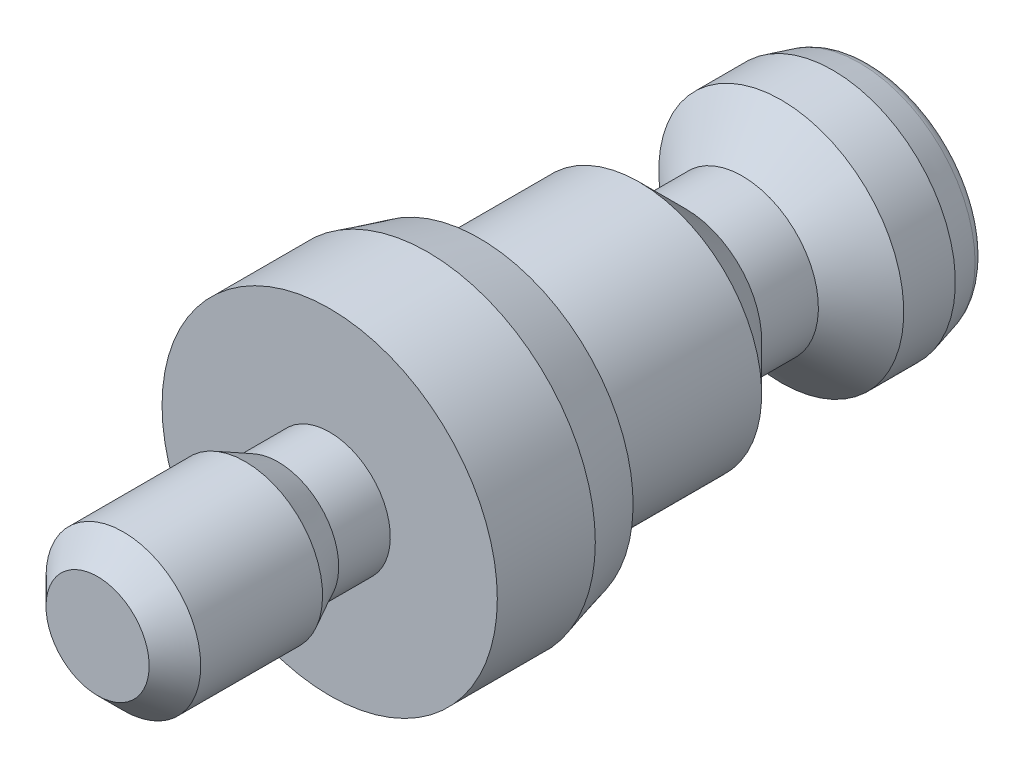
ISO-10303-21;
HEADER;
FILE_DESCRIPTION(('STEP AP214'),'2;1');
FILE_NAME('part.step','',(''),(''),'','','');
FILE_SCHEMA(('AUTOMOTIVE_DESIGN { 1 0 10303 214 1 1 1 1 }'));
ENDSEC;
DATA;
#1=APPLICATION_CONTEXT('core data for automotive mechanical design processes');
#2=APPLICATION_PROTOCOL_DEFINITION('international standard','automotive_design',2000,#1);
#3=PRODUCT_CONTEXT('',#1,'mechanical');
#4=PRODUCT('Part','Part','',(#3));
#5=PRODUCT_RELATED_PRODUCT_CATEGORY('part','',(#4));
#6=PRODUCT_DEFINITION_FORMATION('','',#4);
#7=PRODUCT_DEFINITION_CONTEXT('part definition',#1,'design');
#8=PRODUCT_DEFINITION('design','',#6,#7);
#9=PRODUCT_DEFINITION_SHAPE('','',#8);
#10=(LENGTH_UNIT() NAMED_UNIT(*) SI_UNIT(.MILLI.,.METRE.));
#11=(NAMED_UNIT(*) PLANE_ANGLE_UNIT() SI_UNIT($,.RADIAN.));
#12=(NAMED_UNIT(*) SI_UNIT($,.STERADIAN.) SOLID_ANGLE_UNIT());
#13=UNCERTAINTY_MEASURE_WITH_UNIT(LENGTH_MEASURE(1.E-05),#10,'distance_accuracy_value','');
#14=(GEOMETRIC_REPRESENTATION_CONTEXT(3) GLOBAL_UNCERTAINTY_ASSIGNED_CONTEXT((#13)) GLOBAL_UNIT_ASSIGNED_CONTEXT((#10,
#11,#12)) REPRESENTATION_CONTEXT('',''));
#15=CARTESIAN_POINT('',(0.,0.,0.));
#16=DIRECTION('',(0.,0.,1.));
#17=DIRECTION('',(1.,0.,0.));
#18=AXIS2_PLACEMENT_3D('',#15,#16,#17);
#19=CARTESIAN_POINT('',(0.,0.,0.));
#20=DIRECTION('',(0.,0.,-1.));
#21=DIRECTION('',(0.,1.,0.));
#22=AXIS2_PLACEMENT_3D('',#19,#20,#21);
#23=CYLINDRICAL_SURFACE('',#22,4.75);
#24=CARTESIAN_POINT('',(0.,0.,-12.));
#25=DIRECTION('',(0.,0.,-1.));
#26=DIRECTION('',(0.,1.,0.));
#27=AXIS2_PLACEMENT_3D('',#24,#25,#26);
#28=CIRCLE('',#27,4.75);
#29=CARTESIAN_POINT('',(0.,4.75000000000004,-12.));
#30=VERTEX_POINT('',#29);
#31=EDGE_CURVE('E140',#30,#30,#28,.T.);
#32=ORIENTED_EDGE('',*,*,#31,.F.);
#33=EDGE_LOOP('',(#32));
#34=FACE_BOUND('',#33,.T.);
#35=CARTESIAN_POINT('',(0.,0.,-5.8));
#36=DIRECTION('',(0.,0.,1.));
#37=DIRECTION('',(0.,-1.,0.));
#38=AXIS2_PLACEMENT_3D('',#35,#36,#37);
#39=CIRCLE('',#38,4.75);
#40=CARTESIAN_POINT('',(0.,-4.74999999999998,-5.80000000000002));
#41=VERTEX_POINT('',#40);
#42=EDGE_CURVE('E125',#41,#41,#39,.T.);
#43=ORIENTED_EDGE('',*,*,#42,.F.);
#44=EDGE_LOOP('',(#43));
#45=FACE_BOUND('',#44,.T.);
#46=ADVANCED_FACE('F16',(#34,#45),#23,.T.);
#47=CARTESIAN_POINT('',(0.,0.,-13.8));
#48=DIRECTION('',(0.,0.,1.));
#49=DIRECTION('',(0.,-1.,0.));
#50=AXIS2_PLACEMENT_3D('',#47,#48,#49);
#51=CONICAL_SURFACE('',#50,2.95,0.785398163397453);
#52=ORIENTED_EDGE('',*,*,#31,.T.);
#53=EDGE_LOOP('',(#52));
#54=FACE_BOUND('',#53,.T.);
#55=CARTESIAN_POINT('',(0.,0.,-13.8));
#56=DIRECTION('',(0.,0.,-1.));
#57=DIRECTION('',(0.,1.,0.));
#58=AXIS2_PLACEMENT_3D('',#55,#56,#57);
#59=CIRCLE('',#58,2.95);
#60=CARTESIAN_POINT('',(0.,2.95000000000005,-13.8));
#61=VERTEX_POINT('',#60);
#62=EDGE_CURVE('E137',#61,#61,#59,.T.);
#63=ORIENTED_EDGE('',*,*,#62,.F.);
#64=EDGE_LOOP('',(#63));
#65=FACE_BOUND('',#64,.T.);
#66=ADVANCED_FACE('F171',(#54,#65),#51,.T.);
#67=CARTESIAN_POINT('',(0.,0.,0.));
#68=DIRECTION('',(0.,0.,-1.));
#69=DIRECTION('',(0.,1.,0.));
#70=AXIS2_PLACEMENT_3D('',#67,#68,#69);
#71=CYLINDRICAL_SURFACE('',#70,2.95);
#72=ORIENTED_EDGE('',*,*,#62,.T.);
#73=EDGE_LOOP('',(#72));
#74=FACE_BOUND('',#73,.T.);
#75=CARTESIAN_POINT('',(0.,0.,-16.));
#76=DIRECTION('',(0.,0.,-1.));
#77=DIRECTION('',(0.,1.,0.));
#78=AXIS2_PLACEMENT_3D('',#75,#76,#77);
#79=CIRCLE('',#78,2.95);
#80=CARTESIAN_POINT('',(0.,2.95000000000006,-16.));
#81=VERTEX_POINT('',#80);
#82=EDGE_CURVE('E134',#81,#81,#79,.T.);
#83=ORIENTED_EDGE('',*,*,#82,.F.);
#84=EDGE_LOOP('',(#83));
#85=FACE_BOUND('',#84,.T.);
#86=ADVANCED_FACE('F178',(#74,#85),#71,.T.);
#87=CARTESIAN_POINT('',(0.,0.,-17.5103793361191));
#88=DIRECTION('',(0.,0.,-1.));
#89=DIRECTION('',(0.,1.,0.));
#90=AXIS2_PLACEMENT_3D('',#87,#88,#89);
#91=CONICAL_SURFACE('',#90,4.75,0.872664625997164);
#92=ORIENTED_EDGE('',*,*,#82,.T.);
#93=EDGE_LOOP('',(#92));
#94=FACE_BOUND('',#93,.T.);
#95=CARTESIAN_POINT('',(0.,0.,-17.5103793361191));
#96=DIRECTION('',(0.,0.,-1.));
#97=DIRECTION('',(0.,1.,0.));
#98=AXIS2_PLACEMENT_3D('',#95,#96,#97);
#99=CIRCLE('',#98,4.75);
#100=CARTESIAN_POINT('',(0.,4.75000000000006,-17.5103793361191));
#101=VERTEX_POINT('',#100);
#102=EDGE_CURVE('E131',#101,#101,#99,.T.);
#103=ORIENTED_EDGE('',*,*,#102,.F.);
#104=EDGE_LOOP('',(#103));
#105=FACE_BOUND('',#104,.T.);
#106=ADVANCED_FACE('F229',(#94,#105),#91,.T.);
#107=CARTESIAN_POINT('',(0.,0.,0.));
#108=DIRECTION('',(0.,0.,-1.));
#109=DIRECTION('',(0.,1.,0.));
#110=AXIS2_PLACEMENT_3D('',#107,#108,#109);
#111=CYLINDRICAL_SURFACE('',#110,4.75);
#112=ORIENTED_EDGE('',*,*,#102,.T.);
#113=EDGE_LOOP('',(#112));
#114=FACE_BOUND('',#113,.T.);
#115=CARTESIAN_POINT('',(0.,0.,-19.5103793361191));
#116=DIRECTION('',(0.,0.,-1.));
#117=DIRECTION('',(0.,1.,0.));
#118=AXIS2_PLACEMENT_3D('',#115,#116,#117);
#119=CIRCLE('',#118,4.75);
#120=CARTESIAN_POINT('',(0.,4.75000000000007,-19.5103793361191));
#121=VERTEX_POINT('',#120);
#122=EDGE_CURVE('E128',#121,#121,#119,.T.);
#123=ORIENTED_EDGE('',*,*,#122,.F.);
#124=EDGE_LOOP('',(#123));
#125=FACE_BOUND('',#124,.T.);
#126=ADVANCED_FACE('F220',(#114,#125),#111,.T.);
#127=CARTESIAN_POINT('',(0.,0.,-21.));
#128=DIRECTION('',(0.,0.,1.));
#129=DIRECTION('',(0.,-1.,0.));
#130=AXIS2_PLACEMENT_3D('',#127,#128,#129);
#131=CONICAL_SURFACE('',#130,4.3508573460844,0.26179938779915);
#132=CARTESIAN_POINT('',(0.,0.,-20.5552914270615));
#133=DIRECTION('',(0.,0.,-1.));
#134=DIRECTION('',(0.,1.,0.));
#135=AXIS2_PLACEMENT_3D('',#132,#133,#134);
#136=CIRCLE('',#135,4.47001664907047);
#137=CARTESIAN_POINT('',(0.,4.47001664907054,-20.5552914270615));
#138=VERTEX_POINT('',#137);
#139=EDGE_CURVE('E152',#138,#138,#136,.F.);
#140=ORIENTED_EDGE('',*,*,#139,.T.);
#141=EDGE_LOOP('',(#140));
#142=FACE_BOUND('',#141,.T.);
#143=ORIENTED_EDGE('',*,*,#122,.T.);
#144=EDGE_LOOP('',(#143));
#145=FACE_BOUND('',#144,.T.);
#146=ADVANCED_FACE('F211',(#142,#145),#131,.T.);
#147=CARTESIAN_POINT('',(4.3508573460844,0.,-21.));
#148=DIRECTION('',(0.,0.,-1.));
#149=DIRECTION('',(0.,1.,0.));
#150=AXIS2_PLACEMENT_3D('',#147,#148,#149);
#151=PLANE('',#150);
#152=DIRECTION('',(0.866025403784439,-0.5,0.));
#153=VECTOR('',#152,1.);
#154=CARTESIAN_POINT('',(0.,1.73205080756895,-21.));
#155=LINE('',#154,#153);
#156=CARTESIAN_POINT('',(0.,1.73205080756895,-21.));
#157=VERTEX_POINT('',#156);
#158=CARTESIAN_POINT('',(1.5,0.866025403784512,-21.));
#159=VERTEX_POINT('',#158);
#160=EDGE_CURVE('E417',#157,#159,#155,.T.);
#161=ORIENTED_EDGE('',*,*,#160,.F.);
#162=DIRECTION('',(0.866025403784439,0.5,0.));
#163=VECTOR('',#162,1.);
#164=CARTESIAN_POINT('',(-1.5,0.866025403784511,-21.));
#165=LINE('',#164,#163);
#166=CARTESIAN_POINT('',(-1.5,0.866025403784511,-21.));
#167=VERTEX_POINT('',#166);
#168=EDGE_CURVE('E100',#167,#157,#165,.T.);
#169=ORIENTED_EDGE('',*,*,#168,.F.);
#170=DIRECTION('',(0.,1.,0.));
#171=VECTOR('',#170,1.);
#172=CARTESIAN_POINT('',(-1.5,-0.866025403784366,-21.));
#173=LINE('',#172,#171);
#174=CARTESIAN_POINT('',(-1.5,-0.866025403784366,-21.));
#175=VERTEX_POINT('',#174);
#176=EDGE_CURVE('E422',#175,#167,#173,.T.);
#177=ORIENTED_EDGE('',*,*,#176,.F.);
#178=DIRECTION('',(-0.866025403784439,0.5,0.));
#179=VECTOR('',#178,1.);
#180=CARTESIAN_POINT('',(0.,-1.7320508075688,-21.));
#181=LINE('',#180,#179);
#182=CARTESIAN_POINT('',(0.,-1.7320508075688,-21.));
#183=VERTEX_POINT('',#182);
#184=EDGE_CURVE('E424',#183,#175,#181,.T.);
#185=ORIENTED_EDGE('',*,*,#184,.F.);
#186=DIRECTION('',(-0.866025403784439,-0.5,0.));
#187=VECTOR('',#186,1.);
#188=CARTESIAN_POINT('',(1.5,-0.866025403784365,-21.));
#189=LINE('',#188,#187);
#190=CARTESIAN_POINT('',(1.5,-0.866025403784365,-21.));
#191=VERTEX_POINT('',#190);
#192=EDGE_CURVE('E60',#191,#183,#189,.T.);
#193=ORIENTED_EDGE('',*,*,#192,.F.);
#194=DIRECTION('',(0.,-1.,0.));
#195=VECTOR('',#194,1.);
#196=CARTESIAN_POINT('',(1.5,0.866025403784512,-21.));
#197=LINE('',#196,#195);
#198=EDGE_CURVE('E56',#159,#191,#197,.T.);
#199=ORIENTED_EDGE('',*,*,#198,.F.);
#200=EDGE_LOOP('',(#161,#169,#177,#185,#193,#199));
#201=FACE_BOUND('',#200,.T.);
#202=CARTESIAN_POINT('',(0.,0.,-21.));
#203=DIRECTION('',(0.,0.,-1.));
#204=DIRECTION('',(0.,1.,0.));
#205=AXIS2_PLACEMENT_3D('',#202,#203,#204);
#206=CIRCLE('',#205,3.89046115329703);
#207=CARTESIAN_POINT('',(0.,3.8904611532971,-21.));
#208=VERTEX_POINT('',#207);
#209=EDGE_CURVE('E149',#208,#208,#206,.T.);
#210=ORIENTED_EDGE('',*,*,#209,.T.);
#211=EDGE_LOOP('',(#210));
#212=FACE_BOUND('',#211,.T.);
#213=ADVANCED_FACE('F208',(#201,#212),#151,.T.);
#214=CARTESIAN_POINT('',(4.75,0.,-5.8));
#215=DIRECTION('',(0.,0.,1.));
#216=DIRECTION('',(0.,-1.,0.));
#217=AXIS2_PLACEMENT_3D('',#214,#215,#216);
#218=PLANE('',#217);
#219=CARTESIAN_POINT('',(0.,0.,-5.8));
#220=DIRECTION('',(0.,0.,1.));
#221=DIRECTION('',(0.,-1.,0.));
#222=AXIS2_PLACEMENT_3D('',#219,#220,#221);
#223=CIRCLE('',#222,5.96410161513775);
#224=CARTESIAN_POINT('',(0.,-5.96410161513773,-5.80000000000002));
#225=VERTEX_POINT('',#224);
#226=EDGE_CURVE('E10',#225,#225,#223,.F.);
#227=ORIENTED_EDGE('',*,*,#226,.T.);
#228=EDGE_LOOP('',(#227));
#229=FACE_BOUND('',#228,.T.);
#230=ORIENTED_EDGE('',*,*,#42,.T.);
#231=EDGE_LOOP('',(#230));
#232=FACE_BOUND('',#231,.T.);
#233=ADVANCED_FACE('F210',(#229,#232),#218,.F.);
#234=CARTESIAN_POINT('',(0.,0.,0.));
#235=DIRECTION('',(0.,0.,1.));
#236=DIRECTION('',(0.,-1.,0.));
#237=AXIS2_PLACEMENT_3D('',#234,#235,#236);
#238=CYLINDRICAL_SURFACE('',#237,6.5);
#239=CARTESIAN_POINT('',(0.,0.,-3.8));
#240=DIRECTION('',(0.,0.,1.));
#241=DIRECTION('',(0.,-1.,0.));
#242=AXIS2_PLACEMENT_3D('',#239,#240,#241);
#243=CIRCLE('',#242,6.5);
#244=CARTESIAN_POINT('',(0.,-6.49999999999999,-3.80000000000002));
#245=VERTEX_POINT('',#244);
#246=EDGE_CURVE('E25',#245,#245,#243,.T.);
#247=ORIENTED_EDGE('',*,*,#246,.T.);
#248=EDGE_LOOP('',(#247));
#249=FACE_BOUND('',#248,.T.);
#250=CARTESIAN_POINT('',(0.,0.,0.));
#251=DIRECTION('',(0.,0.,1.));
#252=DIRECTION('',(0.,-1.,0.));
#253=AXIS2_PLACEMENT_3D('',#250,#251,#252);
#254=CIRCLE('',#253,6.5);
#255=CARTESIAN_POINT('',(0.,-6.5,0.));
#256=VERTEX_POINT('',#255);
#257=EDGE_CURVE('E122',#256,#256,#254,.T.);
#258=ORIENTED_EDGE('',*,*,#257,.F.);
#259=EDGE_LOOP('',(#258));
#260=FACE_BOUND('',#259,.T.);
#261=ADVANCED_FACE('F157',(#249,#260),#238,.T.);
#262=CARTESIAN_POINT('',(0.,0.,0.));
#263=DIRECTION('',(0.,0.,1.));
#264=DIRECTION('',(0.,-1.,0.));
#265=AXIS2_PLACEMENT_3D('',#262,#263,#264);
#266=PLANE('',#265);
#267=ORIENTED_EDGE('',*,*,#257,.T.);
#268=EDGE_LOOP('',(#267));
#269=FACE_BOUND('',#268,.T.);
#270=CARTESIAN_POINT('',(0.,0.,0.));
#271=DIRECTION('',(0.,0.,-1.));
#272=DIRECTION('',(0.,1.,0.));
#273=AXIS2_PLACEMENT_3D('',#270,#271,#272);
#274=CIRCLE('',#273,2.35);
#275=CARTESIAN_POINT('',(0.,2.35,0.));
#276=VERTEX_POINT('',#275);
#277=EDGE_CURVE('E113',#276,#276,#274,.T.);
#278=ORIENTED_EDGE('',*,*,#277,.T.);
#279=EDGE_LOOP('',(#278));
#280=FACE_BOUND('',#279,.T.);
#281=ADVANCED_FACE('F185',(#269,#280),#266,.T.);
#282=CARTESIAN_POINT('',(0.,0.,3.27569682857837));
#283=DIRECTION('',(0.,0.,1.));
#284=DIRECTION('',(0.,-1.,0.));
#285=AXIS2_PLACEMENT_3D('',#282,#283,#284);
#286=CONICAL_SURFACE('',#285,3.,0.471238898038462);
#287=CARTESIAN_POINT('',(0.,0.,2.));
#288=DIRECTION('',(0.,0.,-1.));
#289=DIRECTION('',(0.,1.,0.));
#290=AXIS2_PLACEMENT_3D('',#287,#288,#289);
#291=CIRCLE('',#290,2.35);
#292=CARTESIAN_POINT('',(0.,2.34999999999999,2.00000000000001));
#293=VERTEX_POINT('',#292);
#294=EDGE_CURVE('E116',#293,#293,#291,.T.);
#295=ORIENTED_EDGE('',*,*,#294,.F.);
#296=EDGE_LOOP('',(#295));
#297=FACE_BOUND('',#296,.T.);
#298=CARTESIAN_POINT('',(0.,0.,3.27569682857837));
#299=DIRECTION('',(0.,0.,-1.));
#300=DIRECTION('',(0.,1.,0.));
#301=AXIS2_PLACEMENT_3D('',#298,#299,#300);
#302=CIRCLE('',#301,3.);
#303=CARTESIAN_POINT('',(0.,2.99999999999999,3.27569682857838));
#304=VERTEX_POINT('',#303);
#305=EDGE_CURVE('E119',#304,#304,#302,.T.);
#306=ORIENTED_EDGE('',*,*,#305,.T.);
#307=EDGE_LOOP('',(#306));
#308=FACE_BOUND('',#307,.T.);
#309=ADVANCED_FACE('F188',(#297,#308),#286,.T.);
#310=CARTESIAN_POINT('',(0.,0.,0.));
#311=DIRECTION('',(0.,0.,-1.));
#312=DIRECTION('',(0.,1.,0.));
#313=AXIS2_PLACEMENT_3D('',#310,#311,#312);
#314=CYLINDRICAL_SURFACE('',#313,2.35);
#315=ORIENTED_EDGE('',*,*,#277,.F.);
#316=EDGE_LOOP('',(#315));
#317=FACE_BOUND('',#316,.T.);
#318=ORIENTED_EDGE('',*,*,#294,.T.);
#319=EDGE_LOOP('',(#318));
#320=FACE_BOUND('',#319,.T.);
#321=ADVANCED_FACE('F382',(#317,#320),#314,.T.);
#322=CARTESIAN_POINT('',(0.,0.,9.));
#323=DIRECTION('',(0.,0.,1.));
#324=DIRECTION('',(0.,-1.,0.));
#325=AXIS2_PLACEMENT_3D('',#322,#323,#324);
#326=PLANE('',#325);
#327=CARTESIAN_POINT('',(0.,0.,9.));
#328=DIRECTION('',(0.,0.,1.));
#329=DIRECTION('',(0.,-1.,0.));
#330=AXIS2_PLACEMENT_3D('',#327,#328,#329);
#331=CIRCLE('',#330,2.);
#332=CARTESIAN_POINT('',(0.,-2.00000000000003,8.99999999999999));
#333=VERTEX_POINT('',#332);
#334=EDGE_CURVE('E146',#333,#333,#331,.T.);
#335=ORIENTED_EDGE('',*,*,#334,.T.);
#336=EDGE_LOOP('',(#335));
#337=FACE_BOUND('',#336,.T.);
#338=ADVANCED_FACE('F224',(#337),#326,.T.);
#339=CARTESIAN_POINT('',(0.,0.,0.));
#340=DIRECTION('',(0.,0.,-1.));
#341=DIRECTION('',(0.,1.,0.));
#342=AXIS2_PLACEMENT_3D('',#339,#340,#341);
#343=CYLINDRICAL_SURFACE('',#342,3.);
#344=CARTESIAN_POINT('',(0.,0.,8.));
#345=DIRECTION('',(0.,0.,1.));
#346=DIRECTION('',(0.,-1.,0.));
#347=AXIS2_PLACEMENT_3D('',#344,#345,#346);
#348=CIRCLE('',#347,3.);
#349=CARTESIAN_POINT('',(0.,-3.00000000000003,7.99999999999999));
#350=VERTEX_POINT('',#349);
#351=EDGE_CURVE('E143',#350,#350,#348,.F.);
#352=ORIENTED_EDGE('',*,*,#351,.T.);
#353=EDGE_LOOP('',(#352));
#354=FACE_BOUND('',#353,.T.);
#355=ORIENTED_EDGE('',*,*,#305,.F.);
#356=EDGE_LOOP('',(#355));
#357=FACE_BOUND('',#356,.T.);
#358=ADVANCED_FACE('F193',(#354,#357),#343,.T.);
#359=CARTESIAN_POINT('',(0.,0.,8.));
#360=DIRECTION('',(0.,0.,-1.));
#361=DIRECTION('',(0.,1.,0.));
#362=AXIS2_PLACEMENT_3D('',#359,#360,#361);
#363=CONICAL_SURFACE('',#362,3.,0.78539816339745);
#364=ORIENTED_EDGE('',*,*,#334,.F.);
#365=EDGE_LOOP('',(#364));
#366=FACE_BOUND('',#365,.T.);
#367=ORIENTED_EDGE('',*,*,#351,.F.);
#368=EDGE_LOOP('',(#367));
#369=FACE_BOUND('',#368,.T.);
#370=ADVANCED_FACE('F190',(#366,#369),#363,.T.);
#371=CARTESIAN_POINT('',(0.,0.,-20.4));
#372=DIRECTION('',(0.,0.,-1.));
#373=DIRECTION('',(0.,1.,0.));
#374=AXIS2_PLACEMENT_3D('',#371,#372,#373);
#375=TOROIDAL_SURFACE('',#374,3.89046115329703,0.6);
#376=ORIENTED_EDGE('',*,*,#139,.F.);
#377=EDGE_LOOP('',(#376));
#378=FACE_BOUND('',#377,.T.);
#379=ORIENTED_EDGE('',*,*,#209,.F.);
#380=EDGE_LOOP('',(#379));
#381=FACE_BOUND('',#380,.T.);
#382=ADVANCED_FACE('F192',(#378,#381),#375,.T.);
#383=CARTESIAN_POINT('',(1.5,-0.866025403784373,-18.5));
#384=DIRECTION('',(0.5,-0.866025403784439,0.));
#385=DIRECTION('',(0.866025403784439,0.5,0.));
#386=AXIS2_PLACEMENT_3D('',#383,#384,#385);
#387=PLANE('',#386);
#388=ORIENTED_EDGE('',*,*,#192,.T.);
#389=DIRECTION('',(0.,0.,-1.));
#390=VECTOR('',#389,1.);
#391=CARTESIAN_POINT('',(0.,-1.73205080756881,-18.5));
#392=LINE('',#391,#390);
#393=CARTESIAN_POINT('',(0.,-1.73205080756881,-18.5));
#394=VERTEX_POINT('',#393);
#395=EDGE_CURVE('E111',#394,#183,#392,.T.);
#396=ORIENTED_EDGE('',*,*,#395,.F.);
#397=DIRECTION('',(-0.866025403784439,-0.5,0.));
#398=VECTOR('',#397,1.);
#399=CARTESIAN_POINT('',(1.5,-0.866025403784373,-18.5));
#400=LINE('',#399,#398);
#401=CARTESIAN_POINT('',(1.5,-0.866025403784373,-18.5));
#402=VERTEX_POINT('',#401);
#403=EDGE_CURVE('E33',#402,#394,#400,.T.);
#404=ORIENTED_EDGE('',*,*,#403,.F.);
#405=DIRECTION('',(0.,0.,-1.));
#406=VECTOR('',#405,1.);
#407=CARTESIAN_POINT('',(1.5,-0.866025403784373,-18.5));
#408=LINE('',#407,#406);
#409=EDGE_CURVE('E103',#402,#191,#408,.T.);
#410=ORIENTED_EDGE('',*,*,#409,.T.);
#411=EDGE_LOOP('',(#388,#396,#404,#410));
#412=FACE_BOUND('',#411,.T.);
#413=ADVANCED_FACE('F196',(#412),#387,.F.);
#414=CARTESIAN_POINT('',(1.5,0.866025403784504,-18.5));
#415=DIRECTION('',(1.,0.,0.));
#416=DIRECTION('',(0.,1.,0.));
#417=AXIS2_PLACEMENT_3D('',#414,#415,#416);
#418=PLANE('',#417);
#419=ORIENTED_EDGE('',*,*,#198,.T.);
#420=ORIENTED_EDGE('',*,*,#409,.F.);
#421=DIRECTION('',(0.,-1.,0.));
#422=VECTOR('',#421,1.);
#423=CARTESIAN_POINT('',(1.5,0.866025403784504,-18.5));
#424=LINE('',#423,#422);
#425=CARTESIAN_POINT('',(1.5,0.866025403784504,-18.5));
#426=VERTEX_POINT('',#425);
#427=EDGE_CURVE('E87',#426,#402,#424,.T.);
#428=ORIENTED_EDGE('',*,*,#427,.F.);
#429=DIRECTION('',(0.,0.,-1.));
#430=VECTOR('',#429,1.);
#431=CARTESIAN_POINT('',(1.5,0.866025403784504,-18.5));
#432=LINE('',#431,#430);
#433=EDGE_CURVE('E85',#426,#159,#432,.T.);
#434=ORIENTED_EDGE('',*,*,#433,.T.);
#435=EDGE_LOOP('',(#419,#420,#428,#434));
#436=FACE_BOUND('',#435,.T.);
#437=ADVANCED_FACE('F202',(#436),#418,.F.);
#438=CARTESIAN_POINT('',(0.,1.73205080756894,-18.5));
#439=DIRECTION('',(0.5,0.866025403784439,0.));
#440=DIRECTION('',(-0.866025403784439,0.5,0.));
#441=AXIS2_PLACEMENT_3D('',#438,#439,#440);
#442=PLANE('',#441);
#443=ORIENTED_EDGE('',*,*,#160,.T.);
#444=ORIENTED_EDGE('',*,*,#433,.F.);
#445=DIRECTION('',(0.866025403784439,-0.5,0.));
#446=VECTOR('',#445,1.);
#447=CARTESIAN_POINT('',(0.,1.73205080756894,-18.5));
#448=LINE('',#447,#446);
#449=CARTESIAN_POINT('',(0.,1.73205080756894,-18.5));
#450=VERTEX_POINT('',#449);
#451=EDGE_CURVE('E79',#450,#426,#448,.T.);
#452=ORIENTED_EDGE('',*,*,#451,.F.);
#453=DIRECTION('',(0.,0.,-1.));
#454=VECTOR('',#453,1.);
#455=CARTESIAN_POINT('',(0.,1.73205080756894,-18.5));
#456=LINE('',#455,#454);
#457=EDGE_CURVE('E83',#450,#157,#456,.T.);
#458=ORIENTED_EDGE('',*,*,#457,.T.);
#459=EDGE_LOOP('',(#443,#444,#452,#458));
#460=FACE_BOUND('',#459,.T.);
#461=ADVANCED_FACE('F81',(#460),#442,.F.);
#462=CARTESIAN_POINT('',(-1.5,0.866025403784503,-18.5));
#463=DIRECTION('',(-0.5,0.866025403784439,0.));
#464=DIRECTION('',(-0.866025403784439,-0.5,0.));
#465=AXIS2_PLACEMENT_3D('',#462,#463,#464);
#466=PLANE('',#465);
#467=ORIENTED_EDGE('',*,*,#168,.T.);
#468=ORIENTED_EDGE('',*,*,#457,.F.);
#469=DIRECTION('',(0.866025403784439,0.5,0.));
#470=VECTOR('',#469,1.);
#471=CARTESIAN_POINT('',(-1.5,0.866025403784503,-18.5));
#472=LINE('',#471,#470);
#473=CARTESIAN_POINT('',(-1.5,0.866025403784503,-18.5));
#474=VERTEX_POINT('',#473);
#475=EDGE_CURVE('E88',#474,#450,#472,.T.);
#476=ORIENTED_EDGE('',*,*,#475,.F.);
#477=DIRECTION('',(0.,0.,-1.));
#478=VECTOR('',#477,1.);
#479=CARTESIAN_POINT('',(-1.5,0.866025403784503,-18.5));
#480=LINE('',#479,#478);
#481=EDGE_CURVE('E101',#474,#167,#480,.T.);
#482=ORIENTED_EDGE('',*,*,#481,.T.);
#483=EDGE_LOOP('',(#467,#468,#476,#482));
#484=FACE_BOUND('',#483,.T.);
#485=ADVANCED_FACE('F98',(#484),#466,.F.);
#486=CARTESIAN_POINT('',(-1.5,-0.866025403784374,-18.5));
#487=DIRECTION('',(-1.,0.,0.));
#488=DIRECTION('',(0.,-1.,0.));
#489=AXIS2_PLACEMENT_3D('',#486,#487,#488);
#490=PLANE('',#489);
#491=ORIENTED_EDGE('',*,*,#176,.T.);
#492=ORIENTED_EDGE('',*,*,#481,.F.);
#493=DIRECTION('',(0.,1.,0.));
#494=VECTOR('',#493,1.);
#495=CARTESIAN_POINT('',(-1.5,-0.866025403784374,-18.5));
#496=LINE('',#495,#494);
#497=CARTESIAN_POINT('',(-1.5,-0.866025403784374,-18.5));
#498=VERTEX_POINT('',#497);
#499=EDGE_CURVE('E92',#498,#474,#496,.T.);
#500=ORIENTED_EDGE('',*,*,#499,.F.);
#501=DIRECTION('',(0.,0.,-1.));
#502=VECTOR('',#501,1.);
#503=CARTESIAN_POINT('',(-1.5,-0.866025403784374,-18.5));
#504=LINE('',#503,#502);
#505=EDGE_CURVE('E105',#498,#175,#504,.T.);
#506=ORIENTED_EDGE('',*,*,#505,.T.);
#507=EDGE_LOOP('',(#491,#492,#500,#506));
#508=FACE_BOUND('',#507,.T.);
#509=ADVANCED_FACE('F334',(#508),#490,.F.);
#510=CARTESIAN_POINT('',(0.,-1.73205080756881,-18.5));
#511=DIRECTION('',(-0.5,-0.866025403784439,0.));
#512=DIRECTION('',(0.866025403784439,-0.5,0.));
#513=AXIS2_PLACEMENT_3D('',#510,#511,#512);
#514=PLANE('',#513);
#515=ORIENTED_EDGE('',*,*,#184,.T.);
#516=ORIENTED_EDGE('',*,*,#505,.F.);
#517=DIRECTION('',(-0.866025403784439,0.5,0.));
#518=VECTOR('',#517,1.);
#519=CARTESIAN_POINT('',(0.,-1.73205080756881,-18.5));
#520=LINE('',#519,#518);
#521=EDGE_CURVE('E68',#394,#498,#520,.T.);
#522=ORIENTED_EDGE('',*,*,#521,.F.);
#523=ORIENTED_EDGE('',*,*,#395,.T.);
#524=EDGE_LOOP('',(#515,#516,#522,#523));
#525=FACE_BOUND('',#524,.T.);
#526=ADVANCED_FACE('F167',(#525),#514,.F.);
#527=CARTESIAN_POINT('',(0.,0.,-18.5));
#528=DIRECTION('',(0.,0.,-1.));
#529=DIRECTION('',(0.,1.,0.));
#530=AXIS2_PLACEMENT_3D('',#527,#528,#529);
#531=PLANE('',#530);
#532=ORIENTED_EDGE('',*,*,#499,.T.);
#533=ORIENTED_EDGE('',*,*,#475,.T.);
#534=ORIENTED_EDGE('',*,*,#451,.T.);
#535=ORIENTED_EDGE('',*,*,#427,.T.);
#536=ORIENTED_EDGE('',*,*,#403,.T.);
#537=ORIENTED_EDGE('',*,*,#521,.T.);
#538=EDGE_LOOP('',(#532,#533,#534,#535,#536,#537));
#539=FACE_BOUND('',#538,.T.);
#540=ADVANCED_FACE('F91',(#539),#531,.T.);
#541=CARTESIAN_POINT('',(0.,0.,-3.8));
#542=DIRECTION('',(0.,0.,1.));
#543=DIRECTION('',(0.,-1.,0.));
#544=AXIS2_PLACEMENT_3D('',#541,#542,#543);
#545=CONICAL_SURFACE('',#544,6.5,0.261799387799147);
#546=ORIENTED_EDGE('',*,*,#226,.F.);
#547=EDGE_LOOP('',(#546));
#548=FACE_BOUND('',#547,.T.);
#549=ORIENTED_EDGE('',*,*,#246,.F.);
#550=EDGE_LOOP('',(#549));
#551=FACE_BOUND('',#550,.T.);
#552=ADVANCED_FACE('F18',(#548,#551),#545,.T.);
#553=CLOSED_SHELL('',(#46,#66,#86,#106,#126,#146,#213,#233,#261,#281,#309,#321,#338,#358,#370,
#382,#413,#437,#461,#485,#509,#526,#540,#552));
#554=MANIFOLD_SOLID_BREP('B1',#553);
#555=ADVANCED_BREP_SHAPE_REPRESENTATION('',(#18,#554),#14);
#556=SHAPE_DEFINITION_REPRESENTATION(#9,#555);
ENDSEC;
END-ISO-10303-21;
